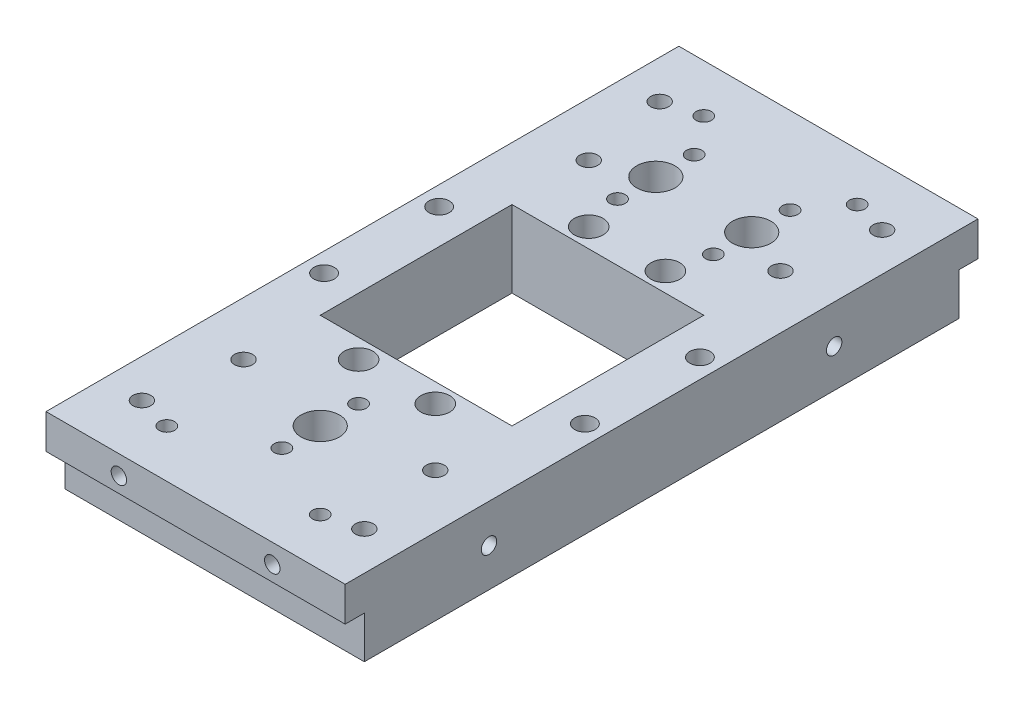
from build123d import *

# Parameters (mm, degrees)
SKETCH1_W                                        = 99.06
SKETCH1_H                                        = 209.55
BOSS_EXTRUDE1_DEPTH                              = 12.7
SKETCH2_W                                        = 63.5
SKETCH2_H                                        = 63.5
CUT_EXTRUDE1_DEPTH                               = 25.4
F_1_4_20_TAPPED_HOLE1_AT_2_COUNT                 = 2
F_1_4_20_TAPPED_HOLE1_AT_2_PITCH                 = 50.8
CBORE_FOR_1_4_SOCKET_HEAD_CAP_SCREW1_D           = 6.7564
CBORE_FOR_1_4_SOCKET_HEAD_CAP_SCREW1_CBORE_D     = 11.1125
CBORE_FOR_1_4_SOCKET_HEAD_CAP_SCREW1_CBORE_DEPTH = 6.35
F_15_64_0_23438_DIAMETER_HOLE1_D                 = 5.953252
F_1_2_0_5_DIAMETER_HOLE1_D                       = 12.7
F_1_4_20_TAPPED_HOLE4_AT_2_COUNT                 = 2
F_1_4_20_TAPPED_HOLE4_AT_2_PITCH                 = 114.3
CUT_EXTRUDE2_REACH                               = 120.643
SKETCH15_R                                       = 4.7625
F_1_4_20_TAPPED_HOLE5_D                          = 5.1054
F_1_4_20_TAPPED_HOLE6_D                          = 5.1054
CUT_EXTRUDE3_REACH                               = 146.748
SKETCH20_W                                       = 6.35
SKETCH20_H                                       = 13.97


with BuildPart() as part:
    # Sketch1 → Boss-Extrude1 (new, symmetric)
    with BuildSketch(Plane(origin=(0, 0, 0), x_dir=(1, 0, 0), z_dir=(0, 1, 0))):
        Rectangle(SKETCH1_W, SKETCH1_H)
    extrude(amount=BOSS_EXTRUDE1_DEPTH, both=True)

    # Sketch2 → Cut-Extrude1 (cut)
    with BuildSketch(Plane(origin=(0, 12.7, 0), x_dir=(1, 0, 0), z_dir=(0, 1, 0))):
        Rectangle(SKETCH2_W, SKETCH2_H)
    extrude(amount=-CUT_EXTRUDE1_DEPTH, mode=Mode.SUBTRACT)

    # Sketch4 → 1_4-20 Tapped Hole1 (revolve, cut)
    with BuildSketch(Plane(origin=(-25.4, 6.35, 104.775), x_dir=(0, -1, 0), z_dir=(1, 0, 0))):
        Polygon((0, 0), (0, 20.583816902), (2.5527, 19.05), (2.5527, 0), align=None)
    f_1_4_20_tapped_hole1 = revolve(axis=Axis((-25.4, 6.35, 111.125), (0, 0, -1)), mode=Mode.SUBTRACT)

    # 1_4-20 Tapped Hole1 at 2: 1_4-20 Tapped Hole1 ×2
    with Locations(*[(i * F_1_4_20_TAPPED_HOLE1_AT_2_PITCH, 0, 0) for i in range(1, F_1_4_20_TAPPED_HOLE1_AT_2_COUNT)]):
        add(f_1_4_20_tapped_hole1, mode=Mode.SUBTRACT)

    # CBORE for 1_4 Socket Head Cap Screw1 (through all)
    with Locations(Plane(origin=(0, -12.7, 0), x_dir=(-1, 0, 0), z_dir=(0, -1, 0))):
        with Locations((43.18, 19.05), (43.18, -19.05), (-43.18, -19.05), (-43.18, 19.05)):
            CounterBoreHole(CBORE_FOR_1_4_SOCKET_HEAD_CAP_SCREW1_D / 2, CBORE_FOR_1_4_SOCKET_HEAD_CAP_SCREW1_CBORE_D / 2, CBORE_FOR_1_4_SOCKET_HEAD_CAP_SCREW1_CBORE_DEPTH)

    # 15_64 _0.23438_ Diameter Hole1 (through all)
    with Locations(Plane(origin=(0, 12.7, 0), x_dir=(1, 0, 0), z_dir=(0, 1, 0))):
        with Locations((-36.83, 85.725), (36.83, 85.725), (36.83, -85.725), (-36.83, -85.725), (-31.75, -57.15), (31.75, -57.15), (31.75, 57.15), (-31.75, 57.15)):
            Hole(F_15_64_0_23438_DIAMETER_HOLE1_D / 2)

    # 1_2 _0.5_ Diameter Hole1 (through all)
    with Locations(Plane(origin=(0, 12.7, 0), x_dir=(1, 0, 0), z_dir=(0, 1, 0))):
        with Locations((0, -63.5), (-15.875, 63.5), (15.875, 63.5)):
            Hole(F_1_2_0_5_DIAMETER_HOLE1_D / 2)

    # Mirror1: 1_4-20 Tapped Hole1 across plane
    add(f_1_4_20_tapped_hole1.mirror(Plane.XY), mode=Mode.SUBTRACT)

    # Mirror1 copy 1 sketch → Mirror1 copy 1 (revolve, cut)
    with BuildSketch(Plane(origin=(25.4, 6.35, -104.775), x_dir=(0, -1, 0), z_dir=(1, 0, 0))):
        Polygon((0, 0), (0, -20.583816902), (2.5527, -19.05), (2.5527, 0), align=None)
    revolve(axis=Axis((25.4, 6.35, -111.125), (0, 0, -1)), mode=Mode.SUBTRACT)

    # Sketch12 → 1_4-20 Tapped Hole4 (revolve, cut)
    with BuildSketch(Plane(origin=(49.53, 0, 57.15), x_dir=(0, 0, -1), z_dir=(0, 1, 0))):
        Polygon((0, 0), (0, 21.853816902), (2.5527, 20.32), (2.5527, 0), align=None)
    f_1_4_20_tapped_hole4 = revolve(axis=Axis((55.88, 0, 57.15), (-1, 0, 0)), mode=Mode.SUBTRACT)

    # 1_4-20 Tapped Hole4 at 2: 1_4-20 Tapped Hole4 ×2
    with Locations(*[(0, 0, -i * F_1_4_20_TAPPED_HOLE4_AT_2_PITCH) for i in range(1, F_1_4_20_TAPPED_HOLE4_AT_2_COUNT)]):
        add(f_1_4_20_tapped_hole4, mode=Mode.SUBTRACT)

    # Mirror2: 1_4-20 Tapped Hole4 across plane
    add(f_1_4_20_tapped_hole4.mirror(Plane(origin=(0, 0, 0), x_dir=(0, 0, 1), z_dir=(1, 0, 0))), mode=Mode.SUBTRACT)

    # Mirror2 copy 1 sketch → Mirror2 copy 1 (revolve, cut)
    with BuildSketch(Plane(origin=(-49.53, 0, -57.15), x_dir=(0, 0, -1), z_dir=(0, 1, 0))):
        Polygon((0, 0), (0, -21.853816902), (2.5527, -20.32), (2.5527, 0), align=None)
    revolve(axis=Axis((-55.88, 0, -57.15), (-1, 0, 0)), mode=Mode.SUBTRACT)

    # Sketch15 → Cut-Extrude2 (cut, up to next)
    with BuildSketch(Plane(origin=(0, 12.7, 0), x_dir=(1, 0, 0), z_dir=(0, 1, 0)), mode=Mode.PRIVATE) as cut_extrude2_sk1:
        with Locations(Location((12.7, -38.1, 0), (0, 0, 270))):
            Circle(SKETCH15_R)
    cut_extrude2_tool1 = extrude(cut_extrude2_sk1.sketch, amount=-CUT_EXTRUDE2_REACH, mode=Mode.PRIVATE) & part.part
    # Sketch15 → Cut-Extrude2 (cut, up to next)
    with BuildSketch(Plane(origin=(0, 12.7, 0), x_dir=(1, 0, 0), z_dir=(0, 1, 0)), mode=Mode.PRIVATE) as cut_extrude2_sk2:
        with Locations(Location((-12.7, -38.1, 0), (0, 0, 270))):
            Circle(SKETCH15_R)
    cut_extrude2_tool2 = extrude(cut_extrude2_sk2.sketch, amount=-CUT_EXTRUDE2_REACH, mode=Mode.PRIVATE) & part.part
    cut_extrude2_1 = cut_extrude2_tool1.solids().sort_by_distance((12.7, 12.7, 38.1))[0]
    add(cut_extrude2_1, mode=Mode.SUBTRACT)
    cut_extrude2_2 = cut_extrude2_tool2.solids().sort_by_distance((-12.7, 12.7, 38.1))[0]
    add(cut_extrude2_2, mode=Mode.SUBTRACT)
    cut_extrude2 = cut_extrude2_1 + cut_extrude2_2  # Cut-Extrude2 as one shape, for the pattern or mirror that repeats it

    # Mirror3: Cut-Extrude2 across plane
    add(cut_extrude2.mirror(Plane.XY), mode=Mode.SUBTRACT)

    # 1_4-20 Tapped Hole5 (through all)
    with Locations(Plane(origin=(0, 12.7, 0), x_dir=(1, 0, 0), z_dir=(0, 1, 0))):
        with Locations((0, -76.2), (0, -50.8), (15.875, 50.8), (15.875, 76.2), (-15.875, 50.8), (-15.875, 76.2)):
            Hole(F_1_4_20_TAPPED_HOLE5_D / 2)

    # 1_4-20 Tapped Hole6 (through all)
    with Locations(Plane(origin=(0, 12.7, 0), x_dir=(1, 0, 0), z_dir=(0, 1, 0))):
        with Locations((-25.4, -88.9), (25.4, -88.9)):
            f_1_4_20_tapped_hole6 = Hole(F_1_4_20_TAPPED_HOLE6_D / 2)

    # Mirror4: 1_4-20 Tapped Hole6 across plane
    add(f_1_4_20_tapped_hole6.mirror(Plane.XY), mode=Mode.SUBTRACT)

    # Sketch20 → Cut-Extrude3 (cut, up to next)
    with BuildSketch(Plane(origin=(49.53, 0, 0), x_dir=(0, 0, -1), z_dir=(1, 0, 0)), mode=Mode.PRIVATE) as cut_extrude3_sk1:
        with Locations((-101.6, -5.715)):
            Rectangle(SKETCH20_W, SKETCH20_H)
    cut_extrude3_tool1 = extrude(cut_extrude3_sk1.sketch, amount=-CUT_EXTRUDE3_REACH, mode=Mode.PRIVATE) & part.part
    cut_extrude3 = cut_extrude3_tool1.solids().sort_by_distance((49.53, -5.715, 101.6))[0]
    add(cut_extrude3, mode=Mode.SUBTRACT)

    # Mirror5: Cut-Extrude3 across plane
    add(cut_extrude3.mirror(Plane.XY), mode=Mode.SUBTRACT)


solid = part.part
